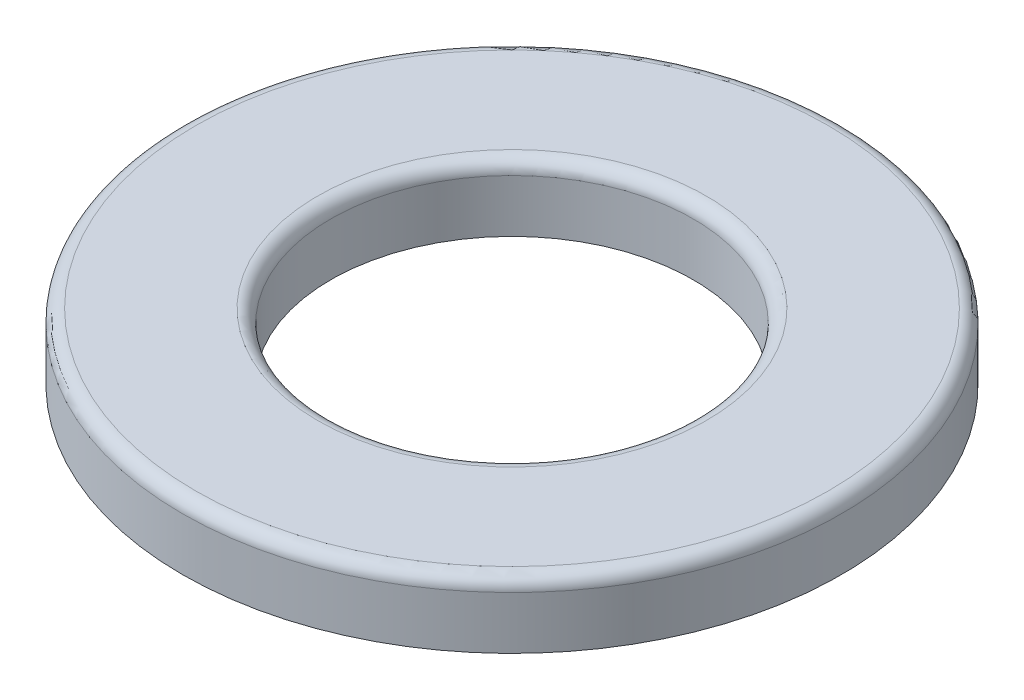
ISO-10303-21;
HEADER;
FILE_DESCRIPTION(('STEP AP214'),'2;1');
FILE_NAME('part.step','',(''),(''),'','','');
FILE_SCHEMA(('AUTOMOTIVE_DESIGN { 1 0 10303 214 1 1 1 1 }'));
ENDSEC;
DATA;
#1=APPLICATION_CONTEXT('core data for automotive mechanical design processes');
#2=APPLICATION_PROTOCOL_DEFINITION('international standard','automotive_design',2000,#1);
#3=PRODUCT_CONTEXT('',#1,'mechanical');
#4=PRODUCT('Part','Part','',(#3));
#5=PRODUCT_RELATED_PRODUCT_CATEGORY('part','',(#4));
#6=PRODUCT_DEFINITION_FORMATION('','',#4);
#7=PRODUCT_DEFINITION_CONTEXT('part definition',#1,'design');
#8=PRODUCT_DEFINITION('design','',#6,#7);
#9=PRODUCT_DEFINITION_SHAPE('','',#8);
#10=(LENGTH_UNIT() NAMED_UNIT(*) SI_UNIT(.MILLI.,.METRE.));
#11=(NAMED_UNIT(*) PLANE_ANGLE_UNIT() SI_UNIT($,.RADIAN.));
#12=(NAMED_UNIT(*) SI_UNIT($,.STERADIAN.) SOLID_ANGLE_UNIT());
#13=UNCERTAINTY_MEASURE_WITH_UNIT(LENGTH_MEASURE(1.E-05),#10,'distance_accuracy_value','');
#14=(GEOMETRIC_REPRESENTATION_CONTEXT(3) GLOBAL_UNCERTAINTY_ASSIGNED_CONTEXT((#13)) GLOBAL_UNIT_ASSIGNED_CONTEXT((#10,
#11,#12)) REPRESENTATION_CONTEXT('',''));
#15=CARTESIAN_POINT('',(0.,0.,0.));
#16=DIRECTION('',(0.,0.,1.));
#17=DIRECTION('',(1.,0.,0.));
#18=AXIS2_PLACEMENT_3D('',#15,#16,#17);
#19=CARTESIAN_POINT('',(0.,0.5,0.));
#20=DIRECTION('',(0.,1.,0.));
#21=DIRECTION('',(0.,0.,1.));
#22=AXIS2_PLACEMENT_3D('',#19,#20,#21);
#23=PLANE('',#22);
#24=CARTESIAN_POINT('',(0.,0.5,0.));
#25=DIRECTION('',(0.,1.,0.));
#26=DIRECTION('',(0.,0.,1.));
#27=AXIS2_PLACEMENT_3D('',#24,#25,#26);
#28=CIRCLE('',#27,4.8);
#29=CARTESIAN_POINT('',(0.,0.5,4.8));
#30=VERTEX_POINT('',#29);
#31=EDGE_CURVE('E46',#30,#30,#28,.T.);
#32=ORIENTED_EDGE('',*,*,#31,.T.);
#33=EDGE_LOOP('',(#32));
#34=FACE_BOUND('',#33,.T.);
#35=CARTESIAN_POINT('',(0.,0.5,0.));
#36=DIRECTION('',(0.,1.,0.));
#37=DIRECTION('',(0.,0.,1.));
#38=AXIS2_PLACEMENT_3D('',#35,#36,#37);
#39=CIRCLE('',#38,2.95);
#40=CARTESIAN_POINT('',(0.,0.5,2.95));
#41=VERTEX_POINT('',#40);
#42=EDGE_CURVE('E50',#41,#41,#39,.F.);
#43=ORIENTED_EDGE('',*,*,#42,.T.);
#44=EDGE_LOOP('',(#43));
#45=FACE_BOUND('',#44,.T.);
#46=ADVANCED_FACE('F35',(#34,#45),#23,.T.);
#47=CARTESIAN_POINT('',(0.,-0.5,0.));
#48=DIRECTION('',(0.,1.,0.));
#49=DIRECTION('',(0.,0.,1.));
#50=AXIS2_PLACEMENT_3D('',#47,#48,#49);
#51=PLANE('',#50);
#52=CARTESIAN_POINT('',(0.,-0.5,0.));
#53=DIRECTION('',(0.,1.,0.));
#54=DIRECTION('',(0.,0.,1.));
#55=AXIS2_PLACEMENT_3D('',#52,#53,#54);
#56=CIRCLE('',#55,5.);
#57=CARTESIAN_POINT('',(0.,-0.5,5.));
#58=VERTEX_POINT('',#57);
#59=EDGE_CURVE('E55',#58,#58,#56,.T.);
#60=ORIENTED_EDGE('',*,*,#59,.F.);
#61=EDGE_LOOP('',(#60));
#62=FACE_BOUND('',#61,.T.);
#63=CARTESIAN_POINT('',(0.,-0.5,0.));
#64=DIRECTION('',(0.,1.,0.));
#65=DIRECTION('',(0.,0.,1.));
#66=AXIS2_PLACEMENT_3D('',#63,#64,#65);
#67=CIRCLE('',#66,2.75);
#68=CARTESIAN_POINT('',(0.,-0.5,2.75));
#69=VERTEX_POINT('',#68);
#70=EDGE_CURVE('E58',#69,#69,#67,.T.);
#71=ORIENTED_EDGE('',*,*,#70,.T.);
#72=EDGE_LOOP('',(#71));
#73=FACE_BOUND('',#72,.T.);
#74=ADVANCED_FACE('F62',(#62,#73),#51,.F.);
#75=CARTESIAN_POINT('',(0.,0.5,0.));
#76=DIRECTION('',(0.,-1.,0.));
#77=DIRECTION('',(0.,0.,-1.));
#78=AXIS2_PLACEMENT_3D('',#75,#76,#77);
#79=CYLINDRICAL_SURFACE('',#78,5.);
#80=CARTESIAN_POINT('',(0.,0.3,0.));
#81=DIRECTION('',(0.,1.,0.));
#82=DIRECTION('',(0.,0.,1.));
#83=AXIS2_PLACEMENT_3D('',#80,#81,#82);
#84=CIRCLE('',#83,5.);
#85=CARTESIAN_POINT('',(0.,0.3,5.));
#86=VERTEX_POINT('',#85);
#87=EDGE_CURVE('E42',#86,#86,#84,.F.);
#88=ORIENTED_EDGE('',*,*,#87,.T.);
#89=EDGE_LOOP('',(#88));
#90=FACE_BOUND('',#89,.T.);
#91=ORIENTED_EDGE('',*,*,#59,.T.);
#92=EDGE_LOOP('',(#91));
#93=FACE_BOUND('',#92,.T.);
#94=ADVANCED_FACE('F67',(#90,#93),#79,.T.);
#95=CARTESIAN_POINT('',(0.,0.5,0.));
#96=DIRECTION('',(0.,-1.,0.));
#97=DIRECTION('',(0.,0.,-1.));
#98=AXIS2_PLACEMENT_3D('',#95,#96,#97);
#99=CYLINDRICAL_SURFACE('',#98,2.75);
#100=CARTESIAN_POINT('',(0.,0.3,0.));
#101=DIRECTION('',(0.,1.,0.));
#102=DIRECTION('',(0.,0.,1.));
#103=AXIS2_PLACEMENT_3D('',#100,#101,#102);
#104=CIRCLE('',#103,2.75);
#105=CARTESIAN_POINT('',(0.,0.3,2.75));
#106=VERTEX_POINT('',#105);
#107=EDGE_CURVE('E10',#106,#106,#104,.T.);
#108=ORIENTED_EDGE('',*,*,#107,.T.);
#109=EDGE_LOOP('',(#108));
#110=FACE_BOUND('',#109,.T.);
#111=ORIENTED_EDGE('',*,*,#70,.F.);
#112=EDGE_LOOP('',(#111));
#113=FACE_BOUND('',#112,.T.);
#114=ADVANCED_FACE('F64',(#110,#113),#99,.F.);
#115=CARTESIAN_POINT('',(0.,0.3,0.));
#116=DIRECTION('',(0.,1.,0.));
#117=DIRECTION('',(0.,0.,1.));
#118=AXIS2_PLACEMENT_3D('',#115,#116,#117);
#119=TOROIDAL_SURFACE('',#118,4.8,0.2);
#120=ORIENTED_EDGE('',*,*,#87,.F.);
#121=EDGE_LOOP('',(#120));
#122=FACE_BOUND('',#121,.T.);
#123=ORIENTED_EDGE('',*,*,#31,.F.);
#124=EDGE_LOOP('',(#123));
#125=FACE_BOUND('',#124,.T.);
#126=ADVANCED_FACE('F66',(#122,#125),#119,.T.);
#127=CARTESIAN_POINT('',(0.,0.3,0.));
#128=DIRECTION('',(0.,1.,0.));
#129=DIRECTION('',(0.,0.,1.));
#130=AXIS2_PLACEMENT_3D('',#127,#128,#129);
#131=TOROIDAL_SURFACE('',#130,2.95,0.2);
#132=ORIENTED_EDGE('',*,*,#42,.F.);
#133=EDGE_LOOP('',(#132));
#134=FACE_BOUND('',#133,.T.);
#135=ORIENTED_EDGE('',*,*,#107,.F.);
#136=EDGE_LOOP('',(#135));
#137=FACE_BOUND('',#136,.T.);
#138=ADVANCED_FACE('F37',(#134,#137),#131,.T.);
#139=CLOSED_SHELL('',(#46,#74,#94,#114,#126,#138));
#140=MANIFOLD_SOLID_BREP('B2',#139);
#141=ADVANCED_BREP_SHAPE_REPRESENTATION('',(#18,#140),#14);
#142=SHAPE_DEFINITION_REPRESENTATION(#9,#141);
ENDSEC;
END-ISO-10303-21;
